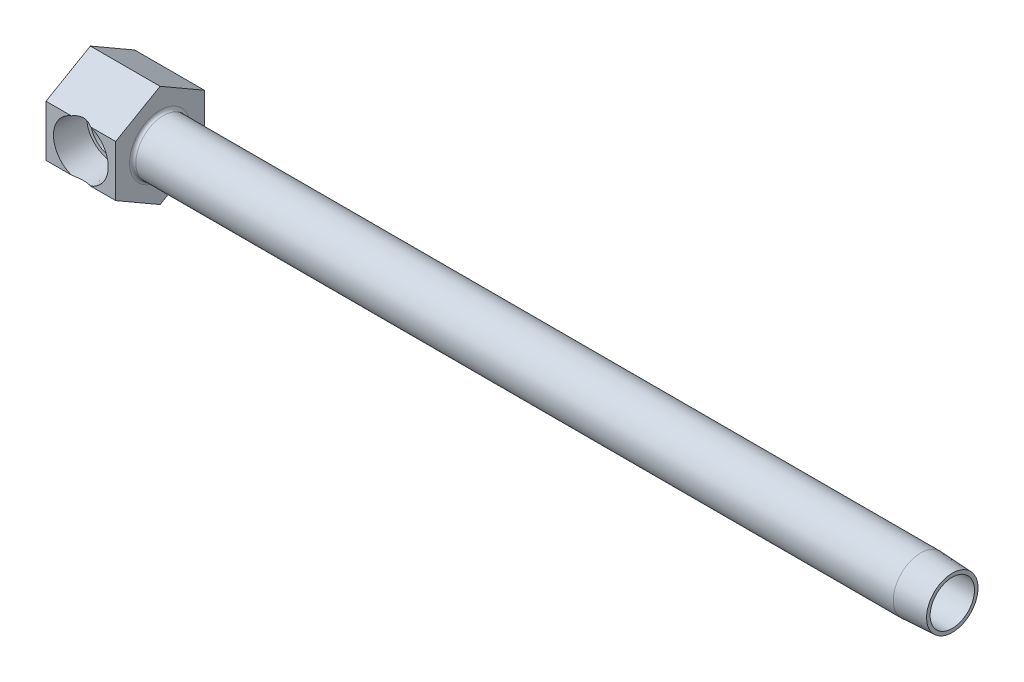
ISO-10303-21;
HEADER;
FILE_DESCRIPTION(('STEP AP214'),'2;1');
FILE_NAME('part.step','',(''),(''),'','','');
FILE_SCHEMA(('AUTOMOTIVE_DESIGN { 1 0 10303 214 1 1 1 1 }'));
ENDSEC;
DATA;
#1=APPLICATION_CONTEXT('core data for automotive mechanical design processes');
#2=APPLICATION_PROTOCOL_DEFINITION('international standard','automotive_design',2000,#1);
#3=PRODUCT_CONTEXT('',#1,'mechanical');
#4=PRODUCT('Part','Part','',(#3));
#5=PRODUCT_RELATED_PRODUCT_CATEGORY('part','',(#4));
#6=PRODUCT_DEFINITION_FORMATION('','',#4);
#7=PRODUCT_DEFINITION_CONTEXT('part definition',#1,'design');
#8=PRODUCT_DEFINITION('design','',#6,#7);
#9=PRODUCT_DEFINITION_SHAPE('','',#8);
#10=(LENGTH_UNIT() NAMED_UNIT(*) SI_UNIT(.MILLI.,.METRE.));
#11=(NAMED_UNIT(*) PLANE_ANGLE_UNIT() SI_UNIT($,.RADIAN.));
#12=(NAMED_UNIT(*) SI_UNIT($,.STERADIAN.) SOLID_ANGLE_UNIT());
#13=UNCERTAINTY_MEASURE_WITH_UNIT(LENGTH_MEASURE(1.E-05),#10,'distance_accuracy_value','');
#14=(GEOMETRIC_REPRESENTATION_CONTEXT(3) GLOBAL_UNCERTAINTY_ASSIGNED_CONTEXT((#13)) GLOBAL_UNIT_ASSIGNED_CONTEXT((#10,
#11,#12)) REPRESENTATION_CONTEXT('',''));
#15=CARTESIAN_POINT('',(0.,0.,0.));
#16=DIRECTION('',(0.,0.,1.));
#17=DIRECTION('',(1.,0.,0.));
#18=AXIS2_PLACEMENT_3D('',#15,#16,#17);
#19=CARTESIAN_POINT('',(63.5,0.,11.1125));
#20=DIRECTION('',(-1.,0.,0.));
#21=DIRECTION('',(0.,0.,1.));
#22=AXIS2_PLACEMENT_3D('',#19,#20,#21);
#23=CYLINDRICAL_SURFACE('',#22,6.858);
#24=CARTESIAN_POINT('',(18.2499,0.,11.1125));
#25=DIRECTION('',(-1.,0.,0.));
#26=DIRECTION('',(0.,-1.,0.));
#27=AXIS2_PLACEMENT_3D('',#24,#25,#26);
#28=CIRCLE('',#27,6.858);
#29=CARTESIAN_POINT('',(18.2499,-6.858,11.1125));
#30=VERTEX_POINT('',#29);
#31=EDGE_CURVE('E22',#30,#30,#28,.F.);
#32=ORIENTED_EDGE('',*,*,#31,.T.);
#33=EDGE_LOOP('',(#32));
#34=FACE_BOUND('',#33,.T.);
#35=CARTESIAN_POINT('',(207.9752,0.,11.1125));
#36=DIRECTION('',(1.,0.,0.));
#37=DIRECTION('',(0.,0.,-1.));
#38=AXIS2_PLACEMENT_3D('',#35,#36,#37);
#39=CIRCLE('',#38,6.858);
#40=CARTESIAN_POINT('',(207.9752,0.,4.2545));
#41=VERTEX_POINT('',#40);
#42=EDGE_CURVE('E156',#41,#41,#39,.T.);
#43=ORIENTED_EDGE('',*,*,#42,.F.);
#44=EDGE_LOOP('',(#43));
#45=FACE_BOUND('',#44,.T.);
#46=ADVANCED_FACE('F15',(#34,#45),#23,.T.);
#47=CARTESIAN_POINT('',(8.7376,0.,22.225));
#48=DIRECTION('',(0.,0.,1.));
#49=DIRECTION('',(1.,0.,0.));
#50=AXIS2_PLACEMENT_3D('',#47,#48,#49);
#51=CONICAL_SURFACE('',#50,6.858,0.0523598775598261);
#52=CARTESIAN_POINT('',(8.7376,-0.680996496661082,34.5170205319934));
#53=DIRECTION('',(0.,-0.866025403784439,-0.5));
#54=DIRECTION('',(0.,-0.5,0.866025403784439));
#55=AXIS2_PLACEMENT_3D('',#52,#53,#54);
#56=ELLIPSE('',#55,15.0043949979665,7.47122554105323);
#57=CARTESIAN_POINT('',(11.1603281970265,6.4158048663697,22.225));
#58=VERTEX_POINT('',#57);
#59=CARTESIAN_POINT('',(6.3148718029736,6.4158048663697,22.225));
#60=VERTEX_POINT('',#59);
#61=EDGE_CURVE('E232',#58,#60,#56,.F.);
#62=ORIENTED_EDGE('',*,*,#61,.T.);
#63=CARTESIAN_POINT('',(8.7376,0.,22.225));
#64=DIRECTION('',(0.,0.,-1.));
#65=DIRECTION('',(-1.,0.,0.));
#66=AXIS2_PLACEMENT_3D('',#63,#64,#65);
#67=CIRCLE('',#66,6.858);
#68=CARTESIAN_POINT('',(6.31487180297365,-6.41580486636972,22.225));
#69=VERTEX_POINT('',#68);
#70=EDGE_CURVE('E36',#69,#60,#67,.T.);
#71=ORIENTED_EDGE('',*,*,#70,.F.);
#72=CARTESIAN_POINT('',(8.7376,0.680996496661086,34.5170205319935));
#73=DIRECTION('',(0.,0.866025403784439,-0.5));
#74=DIRECTION('',(0.,0.5,0.866025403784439));
#75=AXIS2_PLACEMENT_3D('',#72,#73,#74);
#76=ELLIPSE('',#75,15.0043949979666,7.47122554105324);
#77=CARTESIAN_POINT('',(11.1603281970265,-6.4158048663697,22.225));
#78=VERTEX_POINT('',#77);
#79=EDGE_CURVE('E10',#69,#78,#76,.F.);
#80=ORIENTED_EDGE('',*,*,#79,.T.);
#81=EDGE_CURVE('E249',#58,#78,#67,.T.);
#82=ORIENTED_EDGE('',*,*,#81,.F.);
#83=EDGE_LOOP('',(#62,#71,#80,#82));
#84=FACE_BOUND('',#83,.T.);
#85=CARTESIAN_POINT('',(8.7376,0.,14.3002));
#86=DIRECTION('',(0.,0.,-1.));
#87=DIRECTION('',(-1.,0.,0.));
#88=AXIS2_PLACEMENT_3D('',#85,#86,#87);
#89=CIRCLE('',#88,6.44267883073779);
#90=CARTESIAN_POINT('',(13.3057672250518,-4.54312213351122,14.3002));
#91=VERTEX_POINT('',#90);
#92=CARTESIAN_POINT('',(13.3057672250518,4.54312213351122,14.3002));
#93=VERTEX_POINT('',#92);
#94=EDGE_CURVE('E251',#91,#93,#89,.T.);
#95=ORIENTED_EDGE('',*,*,#94,.T.);
#96=CARTESIAN_POINT('',(13.3056128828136,4.54326245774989,14.3));
#97=CARTESIAN_POINT('',(13.4050037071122,4.45290836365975,14.4287190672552));
#98=CARTESIAN_POINT('',(13.5038252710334,4.35690222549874,14.5539811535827));
#99=CARTESIAN_POINT('',(13.6989301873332,4.15324987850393,14.7972290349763));
#100=CARTESIAN_POINT('',(13.7952093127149,4.04558563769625,14.9152031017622));
#101=CARTESIAN_POINT('',(13.9843700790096,3.81752411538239,15.1441485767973));
#102=CARTESIAN_POINT('',(14.0772125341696,3.69701926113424,15.25504596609));
#103=CARTESIAN_POINT('',(14.2568464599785,3.44414434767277,15.4675620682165));
#104=CARTESIAN_POINT('',(14.3436418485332,3.31178210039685,15.5691868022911));
#105=CARTESIAN_POINT('',(14.5527686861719,2.962976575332,15.8122617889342));
#106=CARTESIAN_POINT('',(14.6701286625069,2.73858307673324,15.9469651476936));
#107=CARTESIAN_POINT('',(14.8276174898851,2.38307262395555,16.1264780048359));
#108=CARTESIAN_POINT('',(14.8769849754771,2.2615363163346,16.1825173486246));
#109=CARTESIAN_POINT('',(14.9687772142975,2.0125151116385,16.2864098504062));
#110=CARTESIAN_POINT('',(15.0112056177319,1.88503338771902,16.3342673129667));
#111=CARTESIAN_POINT('',(15.088733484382,1.6232487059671,16.4215218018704));
#112=CARTESIAN_POINT('',(15.1237419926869,1.48888366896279,16.4608139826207));
#113=CARTESIAN_POINT('',(15.1849785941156,1.21573970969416,16.5294343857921));
#114=CARTESIAN_POINT('',(15.2112114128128,1.0769632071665,16.5587679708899));
#115=CARTESIAN_POINT('',(15.2542466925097,0.796159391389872,16.6068431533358));
#116=CARTESIAN_POINT('',(15.2710505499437,0.654132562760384,16.6255863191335));
#117=CARTESIAN_POINT('',(15.2947665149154,0.368243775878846,16.6520290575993));
#118=CARTESIAN_POINT('',(15.3016803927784,0.22438215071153,16.6597306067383));
#119=CARTESIAN_POINT('',(15.3051381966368,-0.0413792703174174,16.6635827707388));
#120=CARTESIAN_POINT('',(15.3031178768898,-0.163241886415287,16.6613326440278));
#121=CARTESIAN_POINT('',(15.2919140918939,-0.406265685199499,16.6488476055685));
#122=CARTESIAN_POINT('',(15.282728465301,-0.527426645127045,16.6386102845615));
#123=CARTESIAN_POINT('',(15.2573805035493,-0.768029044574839,16.6103343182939));
#124=CARTESIAN_POINT('',(15.2412218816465,-0.88747136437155,16.5922998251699));
#125=CARTESIAN_POINT('',(15.2022471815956,-1.1238947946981,16.5487418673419));
#126=CARTESIAN_POINT('',(15.1794285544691,-1.24087494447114,16.5232155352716));
#127=CARTESIAN_POINT('',(15.1030013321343,-1.58064044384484,16.4375716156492));
#128=CARTESIAN_POINT('',(15.0406598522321,-1.79907617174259,16.3675454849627));
#129=CARTESIAN_POINT('',(14.8959772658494,-2.2198653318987,16.2041288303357));
#130=CARTESIAN_POINT('',(14.8136249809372,-2.42220969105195,16.1107252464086));
#131=CARTESIAN_POINT('',(14.6581620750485,-2.75475802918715,15.9330467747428));
#132=CARTESIAN_POINT('',(14.588877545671,-2.88934500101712,15.8534887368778));
#133=CARTESIAN_POINT('',(14.4433958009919,-3.14876465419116,15.6853070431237));
#134=CARTESIAN_POINT('',(14.3671982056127,-3.27359679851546,15.5966828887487));
#135=CARTESIAN_POINT('',(14.2091096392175,-3.51355050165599,15.4112660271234));
#136=CARTESIAN_POINT('',(14.1272094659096,-3.62865566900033,15.3144600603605));
#137=CARTESIAN_POINT('',(13.9591121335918,-3.84892561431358,15.1136697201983));
#138=CARTESIAN_POINT('',(13.8729164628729,-3.95409379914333,15.0096878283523));
#139=CARTESIAN_POINT('',(13.7069469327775,-4.14374167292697,14.806812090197));
#140=CARTESIAN_POINT('',(13.62749258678,-4.22922772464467,14.7085925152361));
#141=CARTESIAN_POINT('',(13.4673498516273,-4.39212627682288,14.5076746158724));
#142=CARTESIAN_POINT('',(13.386669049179,-4.46957495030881,14.404999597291));
#143=CARTESIAN_POINT('',(13.3056128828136,-4.54326245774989,14.3));
#144=B_SPLINE_CURVE_WITH_KNOTS('',3,(#96,#97,#98,#99,#100,#101,#102,#103,#104,#105,#106,#107,
#108,#109,#110,#111,#112,#113,#114,#115,#116,#117,#118,#119,#120,#121,#122,#123,#124,#125,#126,
#127,#128,#129,#130,#131,#132,#133,#134,#135,#136,#137,#138,#139,#140,#141,#142,#143),
.UNSPECIFIED.,.F.,.F.,(4,2,2,2,2,2,2,2,2,2,2,2,2,2,2,2,2,2,2,2,2,2,2,4),(0.,0.55807217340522,
1.11702021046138,1.68108674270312,2.24478434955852,3.10140634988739,3.52893103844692,
3.95623010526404,4.38849766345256,4.82053207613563,5.25250248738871,5.68439556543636,
6.04963287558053,6.41498039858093,6.78013360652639,7.14542675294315,7.85550743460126,
8.56598569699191,9.07835413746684,9.59075076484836,10.1039943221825,10.6170612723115,
11.0743952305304,11.5295724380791),.UNSPECIFIED.);
#145=EDGE_CURVE('E130',#93,#91,#144,.T.);
#146=ORIENTED_EDGE('',*,*,#145,.T.);
#147=EDGE_LOOP('',(#95,#146));
#148=FACE_BOUND('',#147,.T.);
#149=ADVANCED_FACE('F138',(#84,#148),#51,.F.);
#150=CARTESIAN_POINT('',(15.1802788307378,0.,14.3002));
#151=DIRECTION('',(0.,0.,1.));
#152=DIRECTION('',(1.,0.,0.));
#153=AXIS2_PLACEMENT_3D('',#150,#151,#152);
#154=PLANE('',#153);
#155=ORIENTED_EDGE('',*,*,#94,.F.);
#156=DIRECTION('',(1.,0.,0.));
#157=VECTOR('',#156,1.);
#158=CARTESIAN_POINT('',(65.6255637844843,-4.54312213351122,14.3002));
#159=LINE('',#158,#157);
#160=CARTESIAN_POINT('',(11.9253,-4.54312213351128,14.3002));
#161=VERTEX_POINT('',#160);
#162=EDGE_CURVE('E128',#91,#161,#159,.F.);
#163=ORIENTED_EDGE('',*,*,#162,.T.);
#164=CARTESIAN_POINT('',(8.7376,0.,14.3002));
#165=DIRECTION('',(0.,0.,-1.));
#166=DIRECTION('',(-1.,0.,0.));
#167=AXIS2_PLACEMENT_3D('',#164,#165,#166);
#168=CIRCLE('',#167,5.5499);
#169=CARTESIAN_POINT('',(11.9253,4.54312213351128,14.3002));
#170=VERTEX_POINT('',#169);
#171=EDGE_CURVE('E120',#161,#170,#168,.T.);
#172=ORIENTED_EDGE('',*,*,#171,.T.);
#173=DIRECTION('',(1.,0.,0.));
#174=VECTOR('',#173,1.);
#175=CARTESIAN_POINT('',(65.6255637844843,4.54312213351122,14.3002));
#176=LINE('',#175,#174);
#177=EDGE_CURVE('E123',#170,#93,#176,.T.);
#178=ORIENTED_EDGE('',*,*,#177,.T.);
#179=EDGE_LOOP('',(#155,#163,#172,#178));
#180=FACE_BOUND('',#179,.T.);
#181=ADVANCED_FACE('F181',(#180),#154,.T.);
#182=CARTESIAN_POINT('',(8.7376,0.,27.6280516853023));
#183=DIRECTION('',(0.,0.,-1.));
#184=DIRECTION('',(-1.,0.,0.));
#185=AXIS2_PLACEMENT_3D('',#182,#183,#184);
#186=CYLINDRICAL_SURFACE('',#185,5.5499);
#187=ORIENTED_EDGE('',*,*,#171,.F.);
#188=CARTESIAN_POINT('',(8.7376,0.,11.1125));
#189=DIRECTION('',(0.707106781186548,0.,-0.707106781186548));
#190=DIRECTION('',(-0.707106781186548,0.,-0.707106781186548));
#191=AXIS2_PLACEMENT_3D('',#188,#189,#190);
#192=ELLIPSE('',#191,7.84874384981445,5.5499);
#193=CARTESIAN_POINT('',(8.7376,-5.5499,11.1125));
#194=VERTEX_POINT('',#193);
#195=EDGE_CURVE('E109',#161,#194,#192,.T.);
#196=ORIENTED_EDGE('',*,*,#195,.T.);
#197=CARTESIAN_POINT('',(8.7376,0.,11.1125));
#198=DIRECTION('',(-0.707106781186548,0.,-0.707106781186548));
#199=DIRECTION('',(0.707106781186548,0.,-0.707106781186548));
#200=AXIS2_PLACEMENT_3D('',#197,#198,#199);
#201=ELLIPSE('',#200,7.84874384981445,5.5499);
#202=CARTESIAN_POINT('',(13.4708637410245,-2.89786203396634,6.37923625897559));
#203=VERTEX_POINT('',#202);
#204=EDGE_CURVE('E104',#194,#203,#201,.F.);
#205=ORIENTED_EDGE('',*,*,#204,.T.);
#206=CARTESIAN_POINT('',(8.7376,0.,6.37923625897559));
#207=DIRECTION('',(0.,0.,-1.));
#208=DIRECTION('',(-1.,0.,0.));
#209=AXIS2_PLACEMENT_3D('',#206,#207,#208);
#210=CIRCLE('',#209,5.5499);
#211=CARTESIAN_POINT('',(13.4708637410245,2.89786203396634,6.37923625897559));
#212=VERTEX_POINT('',#211);
#213=EDGE_CURVE('E136',#203,#212,#210,.T.);
#214=ORIENTED_EDGE('',*,*,#213,.T.);
#215=CARTESIAN_POINT('',(8.7376,5.5499,11.1125));
#216=VERTEX_POINT('',#215);
#217=EDGE_CURVE('E29',#212,#216,#201,.F.);
#218=ORIENTED_EDGE('',*,*,#217,.T.);
#219=EDGE_CURVE('E121',#216,#170,#192,.T.);
#220=ORIENTED_EDGE('',*,*,#219,.T.);
#221=EDGE_LOOP('',(#187,#196,#205,#214,#218,#220));
#222=FACE_BOUND('',#221,.T.);
#223=ADVANCED_FACE('F117',(#222),#186,.F.);
#224=CARTESIAN_POINT('',(8.7376,0.,6.37923625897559));
#225=DIRECTION('',(0.,0.,1.));
#226=DIRECTION('',(1.,0.,0.));
#227=AXIS2_PLACEMENT_3D('',#224,#225,#226);
#228=CONICAL_SURFACE('',#227,5.5499,1.04719755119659);
#229=CARTESIAN_POINT('',(8.7376,0.,3.175));
#230=VERTEX_POINT('',#229);
#231=VERTEX_LOOP('',#230);
#232=FACE_BOUND('',#231,.T.);
#233=ORIENTED_EDGE('',*,*,#213,.F.);
#234=CARTESIAN_POINT('',(13.4710699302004,-2.89818868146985,6.37943625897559));
#235=CARTESIAN_POINT('',(13.420685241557,-2.8185279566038,6.33063423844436));
#236=CARTESIAN_POINT('',(13.3737513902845,-2.73601453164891,6.2828976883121));
#237=CARTESIAN_POINT('',(13.2869939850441,-2.56583570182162,6.19038737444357));
#238=CARTESIAN_POINT('',(13.2471660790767,-2.47817349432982,6.14561180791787));
#239=CARTESIAN_POINT('',(13.1751547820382,-2.29911606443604,6.06025322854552));
#240=CARTESIAN_POINT('',(13.1428940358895,-2.20777091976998,6.01963042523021));
#241=CARTESIAN_POINT('',(13.0851463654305,-2.02119544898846,5.94274790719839));
#242=CARTESIAN_POINT('',(13.0596596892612,-1.92596498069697,5.90648835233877));
#243=CARTESIAN_POINT('',(13.0148514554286,-1.73255643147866,5.83897057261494));
#244=CARTESIAN_POINT('',(12.9955185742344,-1.63438413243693,5.80770321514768));
#245=CARTESIAN_POINT('',(12.9620830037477,-1.4356334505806,5.75050007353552));
#246=CARTESIAN_POINT('',(12.9479806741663,-1.33505490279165,5.72456465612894));
#247=CARTESIAN_POINT('',(12.9240526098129,-1.13183172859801,5.67823452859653));
#248=CARTESIAN_POINT('',(12.9142392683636,-1.0291819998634,5.65785593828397));
#249=CARTESIAN_POINT('',(12.8981074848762,-0.822623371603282,5.62290462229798));
#250=CARTESIAN_POINT('',(12.891789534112,-0.718714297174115,5.60833271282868));
#251=CARTESIAN_POINT('',(12.8810293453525,-0.489671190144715,5.58281999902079));
#252=CARTESIAN_POINT('',(12.8771967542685,-0.364365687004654,5.57314917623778));
#253=CARTESIAN_POINT('',(12.8729275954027,-0.113319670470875,5.56233429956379));
#254=CARTESIAN_POINT('',(12.8724915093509,0.0124209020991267,5.56119145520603));
#255=CARTESIAN_POINT('',(12.874939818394,0.263686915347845,5.567443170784));
#256=CARTESIAN_POINT('',(12.8778249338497,0.389212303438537,5.57483958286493));
#257=CARTESIAN_POINT('',(12.8874191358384,0.639322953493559,5.59811647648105));
#258=CARTESIAN_POINT('',(12.8941278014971,0.763908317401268,5.61399602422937));
#259=CARTESIAN_POINT('',(12.9116197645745,1.00072761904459,5.65236645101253));
#260=CARTESIAN_POINT('',(12.9220027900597,1.11310193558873,5.6741708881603));
#261=CARTESIAN_POINT('',(12.9479188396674,1.33574469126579,5.72453194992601));
#262=CARTESIAN_POINT('',(12.9634519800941,1.44601308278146,5.75308872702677));
#263=CARTESIAN_POINT('',(13.00082798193,1.66326683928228,5.81649299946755));
#264=CARTESIAN_POINT('',(13.022650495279,1.77026157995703,5.85132007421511));
#265=CARTESIAN_POINT('',(13.0737132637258,1.98033019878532,5.92673676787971));
#266=CARTESIAN_POINT('',(13.1029503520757,2.08340572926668,5.96732392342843));
#267=CARTESIAN_POINT('',(13.1785970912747,2.31167706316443,6.06504898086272));
#268=CARTESIAN_POINT('',(13.2275080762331,2.43541928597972,6.12371071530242));
#269=CARTESIAN_POINT('',(13.3111431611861,2.61414296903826,6.21635789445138));
#270=CARTESIAN_POINT('',(13.3408272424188,2.67271819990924,6.24810824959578));
#271=CARTESIAN_POINT('',(13.4034989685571,2.78735967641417,6.31288069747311));
#272=CARTESIAN_POINT('',(13.4364871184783,2.8434255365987,6.34590298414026));
#273=CARTESIAN_POINT('',(13.4710699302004,2.89818868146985,6.37943625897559));
#274=B_SPLINE_CURVE_WITH_KNOTS('',3,(#234,#235,#236,#237,#238,#239,#240,#241,#242,#243,#244,
#245,#246,#247,#248,#249,#250,#251,#252,#253,#254,#255,#256,#257,#258,#259,#260,#261,#262,#263,
#264,#265,#266,#267,#268,#269,#270,#271,#272,#273),.UNSPECIFIED.,.F.,.F.,(4,2,2,2,2,2,2,2,2,2,2,
2,2,2,2,2,2,2,2,4),(0.,0.318348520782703,0.636501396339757,0.951244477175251,1.26599908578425,
1.58017112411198,1.89436476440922,2.20946038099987,2.52460027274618,2.90145665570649,
3.27836648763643,3.65535808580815,4.03230819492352,4.37682355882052,4.72134670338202,
5.06476748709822,5.40804184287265,5.84309066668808,6.06180090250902,6.28054461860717),.UNSPECIFIED.);
#275=EDGE_CURVE('E111',#203,#212,#274,.T.);
#276=ORIENTED_EDGE('',*,*,#275,.T.);
#277=EDGE_LOOP('',(#233,#276));
#278=FACE_BOUND('',#277,.T.);
#279=ADVANCED_FACE('F148',(#232,#278),#228,.F.);
#280=CARTESIAN_POINT('',(17.4625,12.8316097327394,11.1125));
#281=DIRECTION('',(0.,-0.866025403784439,-0.5));
#282=DIRECTION('',(0.,0.5,-0.866025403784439));
#283=AXIS2_PLACEMENT_3D('',#280,#281,#282);
#284=PLANE('',#283);
#285=ORIENTED_EDGE('',*,*,#61,.F.);
#286=DIRECTION('',(-1.,0.,0.));
#287=VECTOR('',#286,1.);
#288=CARTESIAN_POINT('',(17.4625,6.4158048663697,22.225));
#289=LINE('',#288,#287);
#290=CARTESIAN_POINT('',(17.4625,6.4158048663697,22.225));
#291=VERTEX_POINT('',#290);
#292=EDGE_CURVE('E202',#291,#58,#289,.T.);
#293=ORIENTED_EDGE('',*,*,#292,.F.);
#294=DIRECTION('',(0.,-0.5,0.866025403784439));
#295=VECTOR('',#294,1.);
#296=CARTESIAN_POINT('',(17.4625,12.8316097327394,11.1125));
#297=LINE('',#296,#295);
#298=CARTESIAN_POINT('',(17.4625,12.8316097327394,11.1125));
#299=VERTEX_POINT('',#298);
#300=EDGE_CURVE('E222',#299,#291,#297,.T.);
#301=ORIENTED_EDGE('',*,*,#300,.F.);
#302=DIRECTION('',(-1.,0.,0.));
#303=VECTOR('',#302,1.);
#304=CARTESIAN_POINT('',(17.4625,12.8316097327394,11.1125));
#305=LINE('',#304,#303);
#306=CARTESIAN_POINT('',(0.,12.8316097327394,11.1125));
#307=VERTEX_POINT('',#306);
#308=EDGE_CURVE('E199',#299,#307,#305,.T.);
#309=ORIENTED_EDGE('',*,*,#308,.T.);
#310=DIRECTION('',(0.,-0.5,0.866025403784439));
#311=VECTOR('',#310,1.);
#312=CARTESIAN_POINT('',(0.,12.8316097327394,11.1125));
#313=LINE('',#312,#311);
#314=CARTESIAN_POINT('',(0.,6.4158048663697,22.225));
#315=VERTEX_POINT('',#314);
#316=EDGE_CURVE('E239',#307,#315,#313,.T.);
#317=ORIENTED_EDGE('',*,*,#316,.T.);
#318=EDGE_CURVE('E205',#60,#315,#289,.T.);
#319=ORIENTED_EDGE('',*,*,#318,.F.);
#320=EDGE_LOOP('',(#285,#293,#301,#309,#317,#319));
#321=FACE_BOUND('',#320,.T.);
#322=ADVANCED_FACE('F256',(#321),#284,.F.);
#323=CARTESIAN_POINT('',(17.4625,6.4158048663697,22.225));
#324=DIRECTION('',(0.,0.,-1.));
#325=DIRECTION('',(0.,1.,0.));
#326=AXIS2_PLACEMENT_3D('',#323,#324,#325);
#327=PLANE('',#326);
#328=ORIENTED_EDGE('',*,*,#70,.T.);
#329=ORIENTED_EDGE('',*,*,#318,.T.);
#330=DIRECTION('',(0.,-1.,0.));
#331=VECTOR('',#330,1.);
#332=CARTESIAN_POINT('',(0.,6.4158048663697,22.225));
#333=LINE('',#332,#331);
#334=CARTESIAN_POINT('',(0.,-6.41580486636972,22.225));
#335=VERTEX_POINT('',#334);
#336=EDGE_CURVE('E235',#315,#335,#333,.T.);
#337=ORIENTED_EDGE('',*,*,#336,.T.);
#338=DIRECTION('',(-1.,0.,0.));
#339=VECTOR('',#338,1.);
#340=CARTESIAN_POINT('',(17.4625,-6.41580486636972,22.225));
#341=LINE('',#340,#339);
#342=EDGE_CURVE('E209',#69,#335,#341,.T.);
#343=ORIENTED_EDGE('',*,*,#342,.F.);
#344=EDGE_LOOP('',(#328,#329,#337,#343));
#345=FACE_BOUND('',#344,.T.);
#346=ADVANCED_FACE('F263',(#345),#327,.F.);
#347=ORIENTED_EDGE('',*,*,#81,.T.);
#348=CARTESIAN_POINT('',(17.4625,-6.41580486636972,22.225));
#349=VERTEX_POINT('',#348);
#350=EDGE_CURVE('E206',#349,#78,#341,.T.);
#351=ORIENTED_EDGE('',*,*,#350,.F.);
#352=DIRECTION('',(0.,-1.,0.));
#353=VECTOR('',#352,1.);
#354=CARTESIAN_POINT('',(17.4625,6.4158048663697,22.225));
#355=LINE('',#354,#353);
#356=EDGE_CURVE('E220',#291,#349,#355,.T.);
#357=ORIENTED_EDGE('',*,*,#356,.F.);
#358=ORIENTED_EDGE('',*,*,#292,.T.);
#359=EDGE_LOOP('',(#347,#351,#357,#358));
#360=FACE_BOUND('',#359,.T.);
#361=ADVANCED_FACE('F287',(#360),#327,.F.);
#362=CARTESIAN_POINT('',(17.4625,-6.41580486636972,22.225));
#363=DIRECTION('',(0.,0.866025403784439,-0.5));
#364=DIRECTION('',(0.,0.5,0.866025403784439));
#365=AXIS2_PLACEMENT_3D('',#362,#363,#364);
#366=PLANE('',#365);
#367=ORIENTED_EDGE('',*,*,#79,.F.);
#368=ORIENTED_EDGE('',*,*,#342,.T.);
#369=DIRECTION('',(0.,-0.5,-0.866025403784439));
#370=VECTOR('',#369,1.);
#371=CARTESIAN_POINT('',(0.,-6.41580486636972,22.225));
#372=LINE('',#371,#370);
#373=CARTESIAN_POINT('',(0.,-12.8316097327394,11.1125));
#374=VERTEX_POINT('',#373);
#375=EDGE_CURVE('E218',#335,#374,#372,.T.);
#376=ORIENTED_EDGE('',*,*,#375,.T.);
#377=DIRECTION('',(-1.,0.,0.));
#378=VECTOR('',#377,1.);
#379=CARTESIAN_POINT('',(17.4625,-12.8316097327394,11.1125));
#380=LINE('',#379,#378);
#381=CARTESIAN_POINT('',(17.4625,-12.8316097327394,11.1125));
#382=VERTEX_POINT('',#381);
#383=EDGE_CURVE('E210',#382,#374,#380,.T.);
#384=ORIENTED_EDGE('',*,*,#383,.F.);
#385=DIRECTION('',(0.,-0.5,-0.866025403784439));
#386=VECTOR('',#385,1.);
#387=CARTESIAN_POINT('',(17.4625,-6.41580486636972,22.225));
#388=LINE('',#387,#386);
#389=EDGE_CURVE('E213',#349,#382,#388,.T.);
#390=ORIENTED_EDGE('',*,*,#389,.F.);
#391=ORIENTED_EDGE('',*,*,#350,.T.);
#392=EDGE_LOOP('',(#367,#368,#376,#384,#390,#391));
#393=FACE_BOUND('',#392,.T.);
#394=ADVANCED_FACE('F283',(#393),#366,.F.);
#395=CARTESIAN_POINT('',(17.4625,-12.8316097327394,11.1125));
#396=DIRECTION('',(0.,0.866025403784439,0.5));
#397=DIRECTION('',(0.,-0.5,0.866025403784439));
#398=AXIS2_PLACEMENT_3D('',#395,#396,#397);
#399=PLANE('',#398);
#400=DIRECTION('',(0.,0.5,-0.866025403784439));
#401=VECTOR('',#400,1.);
#402=CARTESIAN_POINT('',(0.,-12.8316097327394,11.1125));
#403=LINE('',#402,#401);
#404=CARTESIAN_POINT('',(0.,-6.41580486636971,0.));
#405=VERTEX_POINT('',#404);
#406=EDGE_CURVE('E227',#374,#405,#403,.T.);
#407=ORIENTED_EDGE('',*,*,#406,.T.);
#408=DIRECTION('',(-1.,0.,0.));
#409=VECTOR('',#408,1.);
#410=CARTESIAN_POINT('',(17.4625,-6.41580486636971,0.));
#411=LINE('',#410,#409);
#412=CARTESIAN_POINT('',(17.4625,-6.41580486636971,0.));
#413=VERTEX_POINT('',#412);
#414=EDGE_CURVE('E191',#413,#405,#411,.T.);
#415=ORIENTED_EDGE('',*,*,#414,.F.);
#416=DIRECTION('',(0.,0.5,-0.866025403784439));
#417=VECTOR('',#416,1.);
#418=CARTESIAN_POINT('',(17.4625,-12.8316097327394,11.1125));
#419=LINE('',#418,#417);
#420=EDGE_CURVE('E214',#382,#413,#419,.T.);
#421=ORIENTED_EDGE('',*,*,#420,.F.);
#422=ORIENTED_EDGE('',*,*,#383,.T.);
#423=EDGE_LOOP('',(#407,#415,#421,#422));
#424=FACE_BOUND('',#423,.T.);
#425=ADVANCED_FACE('F286',(#424),#399,.F.);
#426=CARTESIAN_POINT('',(17.4625,-6.41580486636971,0.));
#427=DIRECTION('',(0.,0.,1.));
#428=DIRECTION('',(1.,0.,0.));
#429=AXIS2_PLACEMENT_3D('',#426,#427,#428);
#430=PLANE('',#429);
#431=DIRECTION('',(0.,1.,0.));
#432=VECTOR('',#431,1.);
#433=CARTESIAN_POINT('',(0.,-6.41580486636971,0.));
#434=LINE('',#433,#432);
#435=CARTESIAN_POINT('',(0.,6.41580486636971,0.));
#436=VERTEX_POINT('',#435);
#437=EDGE_CURVE('E231',#405,#436,#434,.T.);
#438=ORIENTED_EDGE('',*,*,#437,.T.);
#439=DIRECTION('',(-1.,0.,0.));
#440=VECTOR('',#439,1.);
#441=CARTESIAN_POINT('',(17.4625,6.41580486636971,0.));
#442=LINE('',#441,#440);
#443=CARTESIAN_POINT('',(17.4625,6.41580486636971,0.));
#444=VERTEX_POINT('',#443);
#445=EDGE_CURVE('E196',#444,#436,#442,.T.);
#446=ORIENTED_EDGE('',*,*,#445,.F.);
#447=DIRECTION('',(0.,1.,0.));
#448=VECTOR('',#447,1.);
#449=CARTESIAN_POINT('',(17.4625,-6.41580486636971,0.));
#450=LINE('',#449,#448);
#451=EDGE_CURVE('E217',#413,#444,#450,.T.);
#452=ORIENTED_EDGE('',*,*,#451,.F.);
#453=ORIENTED_EDGE('',*,*,#414,.T.);
#454=EDGE_LOOP('',(#438,#446,#452,#453));
#455=FACE_BOUND('',#454,.T.);
#456=ADVANCED_FACE('F294',(#455),#430,.F.);
#457=CARTESIAN_POINT('',(17.4625,6.4158048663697,0.));
#458=DIRECTION('',(0.,-0.866025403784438,0.5));
#459=DIRECTION('',(0.,-0.5,-0.866025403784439));
#460=AXIS2_PLACEMENT_3D('',#457,#458,#459);
#461=PLANE('',#460);
#462=DIRECTION('',(0.,0.5,0.866025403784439));
#463=VECTOR('',#462,1.);
#464=CARTESIAN_POINT('',(0.,6.4158048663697,0.));
#465=LINE('',#464,#463);
#466=EDGE_CURVE('E243',#436,#307,#465,.T.);
#467=ORIENTED_EDGE('',*,*,#466,.T.);
#468=ORIENTED_EDGE('',*,*,#308,.F.);
#469=DIRECTION('',(0.,0.5,0.866025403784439));
#470=VECTOR('',#469,1.);
#471=CARTESIAN_POINT('',(17.4625,6.4158048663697,0.));
#472=LINE('',#471,#470);
#473=EDGE_CURVE('E224',#444,#299,#472,.T.);
#474=ORIENTED_EDGE('',*,*,#473,.F.);
#475=ORIENTED_EDGE('',*,*,#445,.T.);
#476=EDGE_LOOP('',(#467,#468,#474,#475));
#477=FACE_BOUND('',#476,.T.);
#478=ADVANCED_FACE('F281',(#477),#461,.F.);
#479=CARTESIAN_POINT('',(17.4625,-19.2474145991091,22.225));
#480=DIRECTION('',(-1.,0.,0.));
#481=DIRECTION('',(0.,-1.,0.));
#482=AXIS2_PLACEMENT_3D('',#479,#480,#481);
#483=PLANE('',#482);
#484=CARTESIAN_POINT('',(17.4625,0.,11.1125));
#485=DIRECTION('',(-1.,0.,0.));
#486=DIRECTION('',(0.,-1.,0.));
#487=AXIS2_PLACEMENT_3D('',#484,#485,#486);
#488=CIRCLE('',#487,7.6454);
#489=CARTESIAN_POINT('',(17.4625,-7.6454,11.1125));
#490=VERTEX_POINT('',#489);
#491=EDGE_CURVE('E189',#490,#490,#488,.T.);
#492=ORIENTED_EDGE('',*,*,#491,.T.);
#493=EDGE_LOOP('',(#492));
#494=FACE_BOUND('',#493,.T.);
#495=ORIENTED_EDGE('',*,*,#420,.T.);
#496=ORIENTED_EDGE('',*,*,#451,.T.);
#497=ORIENTED_EDGE('',*,*,#473,.T.);
#498=ORIENTED_EDGE('',*,*,#300,.T.);
#499=ORIENTED_EDGE('',*,*,#356,.T.);
#500=ORIENTED_EDGE('',*,*,#389,.T.);
#501=EDGE_LOOP('',(#495,#496,#497,#498,#499,#500));
#502=FACE_BOUND('',#501,.T.);
#503=ADVANCED_FACE('F277',(#494,#502),#483,.F.);
#504=CARTESIAN_POINT('',(0.,-19.2474145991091,22.225));
#505=DIRECTION('',(-1.,0.,0.));
#506=DIRECTION('',(0.,-1.,0.));
#507=AXIS2_PLACEMENT_3D('',#504,#505,#506);
#508=PLANE('',#507);
#509=ORIENTED_EDGE('',*,*,#406,.F.);
#510=ORIENTED_EDGE('',*,*,#375,.F.);
#511=ORIENTED_EDGE('',*,*,#336,.F.);
#512=ORIENTED_EDGE('',*,*,#316,.F.);
#513=ORIENTED_EDGE('',*,*,#466,.F.);
#514=ORIENTED_EDGE('',*,*,#437,.F.);
#515=EDGE_LOOP('',(#509,#510,#511,#512,#513,#514));
#516=FACE_BOUND('',#515,.T.);
#517=ADVANCED_FACE('F274',(#516),#508,.T.);
#518=CARTESIAN_POINT('',(18.2499,0.,11.1125));
#519=DIRECTION('',(-1.,0.,0.));
#520=DIRECTION('',(0.,-1.,0.));
#521=AXIS2_PLACEMENT_3D('',#518,#519,#520);
#522=TOROIDAL_SURFACE('',#521,7.6454,0.7874);
#523=ORIENTED_EDGE('',*,*,#31,.F.);
#524=EDGE_LOOP('',(#523));
#525=FACE_BOUND('',#524,.T.);
#526=ORIENTED_EDGE('',*,*,#491,.F.);
#527=EDGE_LOOP('',(#526));
#528=FACE_BOUND('',#527,.T.);
#529=ADVANCED_FACE('F146',(#525,#528),#522,.F.);
#530=CARTESIAN_POINT('',(65.6255637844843,0.,11.1125));
#531=DIRECTION('',(1.,0.,0.));
#532=DIRECTION('',(0.,0.,-1.));
#533=AXIS2_PLACEMENT_3D('',#530,#531,#532);
#534=CYLINDRICAL_SURFACE('',#533,5.5499);
#535=ORIENTED_EDGE('',*,*,#177,.F.);
#536=ORIENTED_EDGE('',*,*,#219,.F.);
#537=ORIENTED_EDGE('',*,*,#217,.F.);
#538=ORIENTED_EDGE('',*,*,#275,.F.);
#539=ORIENTED_EDGE('',*,*,#204,.F.);
#540=ORIENTED_EDGE('',*,*,#195,.F.);
#541=ORIENTED_EDGE('',*,*,#162,.F.);
#542=ORIENTED_EDGE('',*,*,#145,.F.);
#543=EDGE_LOOP('',(#535,#536,#537,#538,#539,#540,#541,#542));
#544=FACE_BOUND('',#543,.T.);
#545=CARTESIAN_POINT('',(215.9,0.,11.1125));
#546=DIRECTION('',(1.,0.,0.));
#547=DIRECTION('',(0.,0.,-1.));
#548=AXIS2_PLACEMENT_3D('',#545,#546,#547);
#549=CIRCLE('',#548,5.5499);
#550=CARTESIAN_POINT('',(215.9,0.,5.5626));
#551=VERTEX_POINT('',#550);
#552=EDGE_CURVE('E162',#551,#551,#549,.T.);
#553=ORIENTED_EDGE('',*,*,#552,.T.);
#554=EDGE_LOOP('',(#553));
#555=FACE_BOUND('',#554,.T.);
#556=ADVANCED_FACE('F106',(#544,#555),#534,.F.);
#557=CARTESIAN_POINT('',(215.9,0.,11.1125));
#558=DIRECTION('',(-1.,0.,0.));
#559=DIRECTION('',(0.,0.,1.));
#560=AXIS2_PLACEMENT_3D('',#557,#558,#559);
#561=CONICAL_SURFACE('',#560,6.44267883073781,0.052359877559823);
#562=ORIENTED_EDGE('',*,*,#42,.T.);
#563=EDGE_LOOP('',(#562));
#564=FACE_BOUND('',#563,.T.);
#565=CARTESIAN_POINT('',(215.9,0.,11.1125));
#566=DIRECTION('',(1.,0.,0.));
#567=DIRECTION('',(0.,0.,-1.));
#568=AXIS2_PLACEMENT_3D('',#565,#566,#567);
#569=CIRCLE('',#568,6.44267883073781);
#570=CARTESIAN_POINT('',(215.9,0.,4.66982116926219));
#571=VERTEX_POINT('',#570);
#572=EDGE_CURVE('E159',#571,#571,#569,.T.);
#573=ORIENTED_EDGE('',*,*,#572,.F.);
#574=EDGE_LOOP('',(#573));
#575=FACE_BOUND('',#574,.T.);
#576=ADVANCED_FACE('F145',(#564,#575),#561,.T.);
#577=CARTESIAN_POINT('',(215.9,0.,5.5626));
#578=DIRECTION('',(1.,0.,0.));
#579=DIRECTION('',(0.,0.,-1.));
#580=AXIS2_PLACEMENT_3D('',#577,#578,#579);
#581=PLANE('',#580);
#582=ORIENTED_EDGE('',*,*,#572,.T.);
#583=EDGE_LOOP('',(#582));
#584=FACE_BOUND('',#583,.T.);
#585=ORIENTED_EDGE('',*,*,#552,.F.);
#586=EDGE_LOOP('',(#585));
#587=FACE_BOUND('',#586,.T.);
#588=ADVANCED_FACE('F166',(#584,#587),#581,.T.);
#589=CLOSED_SHELL('',(#46,#149,#181,#223,#279,#322,#346,#361,#394,#425,#456,#478,#503,#517,#529,
#556,#576,#588));
#590=MANIFOLD_SOLID_BREP('B1',#589);
#591=ADVANCED_BREP_SHAPE_REPRESENTATION('',(#18,#590),#14);
#592=SHAPE_DEFINITION_REPRESENTATION(#9,#591);
ENDSEC;
END-ISO-10303-21;
